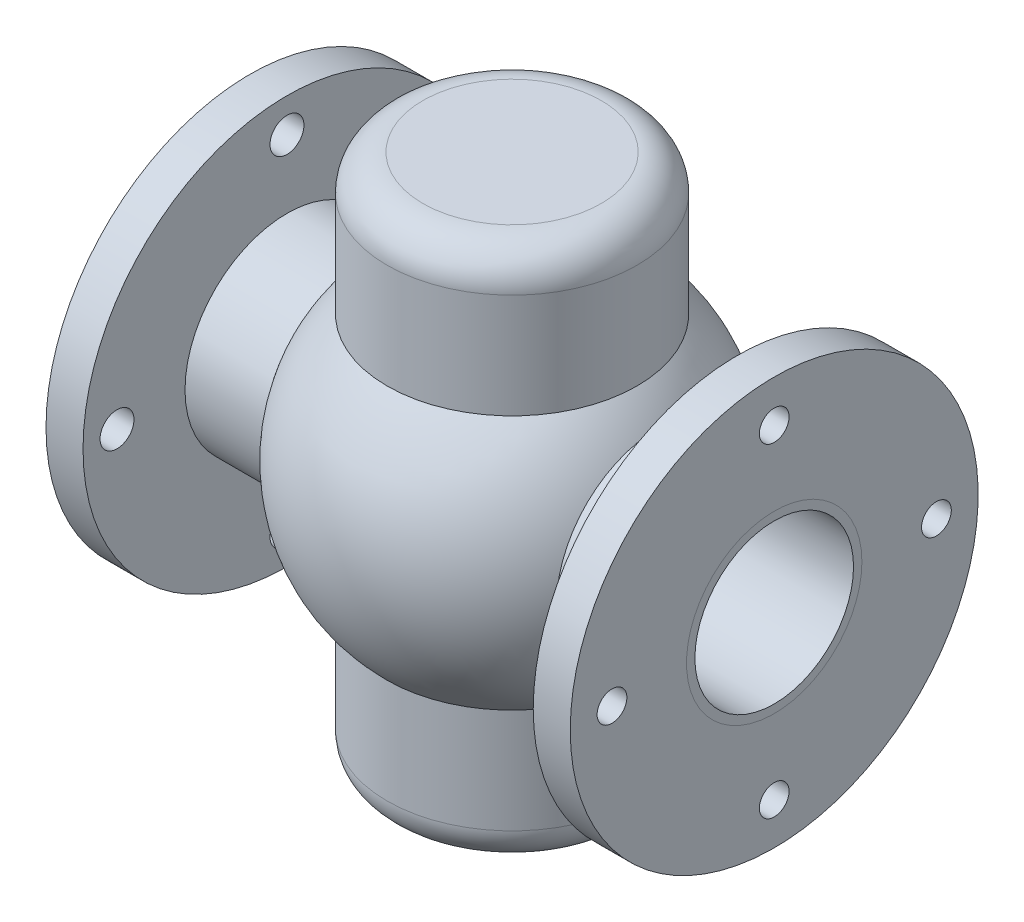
from build123d import *

# Parameters (mm, degrees)
SKETCH1_R                   = 57.15
BASE_EXTRUDE_DEPTH          = 150
BOSS_EXTRUDE1_DEPTH         = 150
BOSS_EXTRUDE1_DEPTH_BACK    = 150
SKETCH2_R                   = 70
FILLET1_R                   = 20
SKETCH18_R                  = 44.45
CUT_EXTRUDE3_DEPTH          = 351.000000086
CUT_EXTRUDE2_REACH          = 353.73
SKETCH15_R                  = 9.5
CIRPATTERN2_COUNT           = 4
SKETCH22_R                  = 67.5
CUT_EXTRUDE5_DEPTH          = 3.1
F_5_8_CLEARANCE_HOLE1_D     = 16.66748
F_5_8_CLEARANCE_HOLE1_DEPTH = 20.75


with BuildPart() as part:
    # Sketch1 → Base-Extrude (new, symmetric)
    with BuildSketch(Plane(origin=(0, 0, 0), x_dir=(0, 0, -1), z_dir=(1, 0, 0))):
        Circle(SKETCH1_R)
    extrude(amount=BASE_EXTRUDE_DEPTH, both=True)

    # Sketch2 → Boss-Extrude1 (add, two sides: drawn at the far end of the back side and taken through both)
    with BuildSketch(Plane(origin=(0, 0, 0), x_dir=(1, 0, 0), z_dir=(0, 1, 0)).offset(-BOSS_EXTRUDE1_DEPTH_BACK)):
        with Locations(Location((0, 0, 0), (0, 0, 270))):
            Circle(SKETCH2_R)
    extrude(amount=BOSS_EXTRUDE1_DEPTH + BOSS_EXTRUDE1_DEPTH_BACK)

    # Sketch3 → Boss-Revolve1 (revolve)
    with BuildSketch(Plane.XY):
        with BuildLine():
            Line((0, -100), (0, 100))
            ThreePointArc((0, 100), (100, 0), (0, -100))
        make_face()
    revolve(axis=Axis((0, -115.862970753, 0), (0, 1, 0)))

    # Fillet1
    fillet1_edges = [part.edges().sort_by_distance(p)[0] for p in [
        (0, -150, -70),
        (0, 150, -70),
    ]]
    fillet(fillet1_edges, radius=FILLET1_R)

    # Sketch18 → Cut-Extrude3 (cut, through all)
    with BuildSketch(Plane.ZY.offset(150)):
        Circle(SKETCH18_R)
    extrude(amount=-CUT_EXTRUDE3_DEPTH, mode=Mode.SUBTRACT)

    # Sketch13 → Boss-Revolve4 (revolve)
    with BuildSketch(Plane.XY, mode=Mode.PRIVATE) as boss_revolve4_sk:
        Polygon((126.15, 57.15), (126.15, 114.3), (146.9, 114.3), (146.9, 67.5), (150, 67.5), (150, 57.15), align=None)
    boss_revolve4 = revolve(boss_revolve4_sk.sketch.rotate(Axis((0, 0, 0), (1, 0, 0)), 90), axis=Axis((0, 0, 0), (1, 0, 0)))

    # Mirror2: Boss-Revolve4 across plane
    add(boss_revolve4.mirror(Plane(origin=(0, 0, 0), x_dir=(0, 0, 1), z_dir=(1, 0, 0))))

    # Sketch15 → Cut-Extrude2 (cut, up to next)
    with BuildSketch(Plane.ZY.offset(146.9), mode=Mode.PRIVATE) as cut_extrude2_sk1:
        with Locations((0, 95.25)):
            Circle(SKETCH15_R)
    cut_extrude2_tool1 = extrude(cut_extrude2_sk1.sketch, amount=-CUT_EXTRUDE2_REACH, mode=Mode.PRIVATE) & part.part
    cut_extrude2 = cut_extrude2_tool1.solids().sort_by_distance((-146.9, 95.25, 0))[0]
    add(cut_extrude2, mode=Mode.SUBTRACT)

    # CirPattern2: Cut-Extrude2 ×4 about axis
    cirpattern2_axis = Axis((0, 0, 0), (1, 0, 0))
    for i in range(1, CIRPATTERN2_COUNT):
        add(cut_extrude2.rotate(cirpattern2_axis, i * 360 / CIRPATTERN2_COUNT), mode=Mode.SUBTRACT)

    # Sketch22 → Cut-Extrude5 (cut)
    with BuildSketch(Plane(origin=(146.9, 0, 0), x_dir=(0, 0, -1), z_dir=(1, 0, 0))):
        with Locations(Location((0, 0, 0), (0, 0, 180))):
            Circle(SKETCH22_R)
    extrude(amount=CUT_EXTRUDE5_DEPTH, mode=Mode.SUBTRACT)

    # 5_8 Clearance Hole1
    with Locations(Plane(origin=(126.15, -86.94526051, 61.229912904), x_dir=(0, 0, 1), z_dir=(-1, 0, 0))):
        with Locations((-61.229912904, 177.798020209), (29.681467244, 86.94526051), (-61.229912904, -3.966119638), (-152.141293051, 86.94526051)):
            Hole(F_5_8_CLEARANCE_HOLE1_D / 2, depth=F_5_8_CLEARANCE_HOLE1_DEPTH)


solid = part.part
